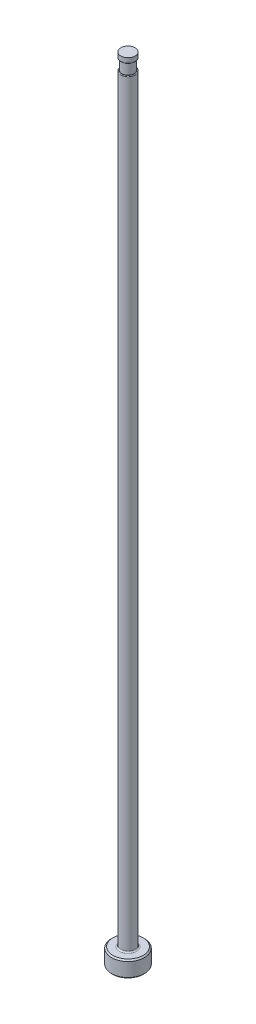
from build123d import *

# Parameters (mm, degrees)
CHAMFER1_SIZE     = 0.254
FILLET1_R         = 0.254
SKETCH2_W         = 0.2032
SKETCH2_H         = 2.032
D_SLOT_DEPTH      = 153.466131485
D_SLOT_DEPTH_BACK = 153.466131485
SKETCH5_W         = 0.00508
SKETCH5_H         = 1.016
FILLET2_R         = 0.127


with BuildPart() as part:
    # Sketch1 → Revolve1 (revolve)
    with BuildSketch(Plane.XY, mode=Mode.PRIVATE) as revolve1_sk:
        Polygon((0, 0), (-3.175, 0), (-3.175, 3.175), (-1.38811, 3.175), (-1.38811, 152.4), (0, 152.4), align=None)
    revolve(revolve1_sk.sketch.rotate(Axis((0, 259.958771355, 0), (0, -1, 0)), 270), axis=Axis((0, 259.958771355, 0), (0, -1, 0)))

    # Chamfer1
    chamfer1_edges = [part.edges().sort_by_distance(p)[0] for p in [
        (0, 3.175, -3.175),
        (0, 0, -3.175),
    ]]
    chamfer(chamfer1_edges, length=CHAMFER1_SIZE)

    # Fillet1
    fillet1_edges = [part.edges().sort_by_distance(p)[0] for p in [
        (0, 3.175, -1.38811),
    ]]
    fillet(fillet1_edges, radius=FILLET1_R)

    # Sketch2 → Vent Relief (revolve, cut)
    with BuildSketch(Plane.XY, mode=Mode.PRIVATE) as vent_relief_sk:
        with Locations((-1.28651, 150.368)):
            Rectangle(SKETCH2_W, SKETCH2_H)
    revolve(vent_relief_sk.sketch.rotate(Axis((0, 153.448281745, 0), (0, -1, 0)), 270), axis=Axis((0, 153.448281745, 0), (0, -1, 0)), mode=Mode.SUBTRACT)

    # Sketch3 → D-Slot (cut, two sides: drawn at the far end of the back side and taken through both)
    with BuildSketch(Plane.XY.offset(-D_SLOT_DEPTH_BACK)):
        with BuildLine():
            Line((-1.18491, 150.368), (-1.18491, 86.868))
            ThreePointArc((-1.18491, 86.868), (-1.236123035, 86.300038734), (-1.38811, 85.7504))
            Line((-1.38811, 85.7504), (-1.38811, 150.368))
            Line((-1.38811, 150.368), (-1.18491, 150.368))
        make_face()
    extrude(amount=D_SLOT_DEPTH + D_SLOT_DEPTH_BACK, mode=Mode.SUBTRACT)

    # Sketch5 → Vent Diameter (revolve, cut)
    with BuildSketch(Plane.XY, mode=Mode.PRIVATE) as vent_diameter_sk:
        with Locations((-1.38557, 151.892)):
            Rectangle(SKETCH5_W, SKETCH5_H)
    revolve(vent_diameter_sk.sketch.rotate(Axis((0, 152.687735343, 0), (0, -1, 0)), 90), axis=Axis((0, 152.687735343, 0), (0, -1, 0)), mode=Mode.SUBTRACT)

    # Fillet2
    fillet2_edges = [part.edges().sort_by_distance(p)[0] for p in [
        (1.210486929, 149.352, -0.679389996),
        (0, 151.384, 1.38303),
    ]]
    fillet(fillet2_edges, radius=FILLET2_R)


solid = part.part
